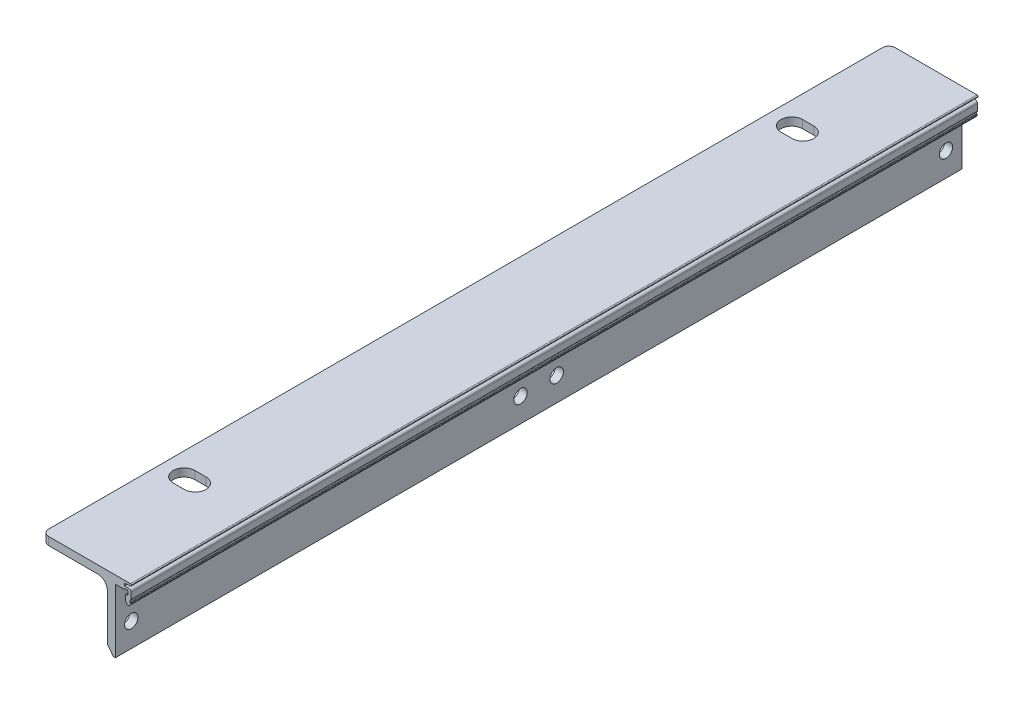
from build123d import *

# Parameters (mm, degrees)
EXTRUDE_1_DEPTH     = 132.675
FILLET_2_R          = 3
CUT_EXTRUDE_1_DEPTH = 2362.760923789
SKETCH_3_R          = 2.1
CUT_EXTRUDE_2_DEPTH = 3316.32239034
FILLET_1_R          = 2


with BuildPart() as part:
    # Sketch 1 → Extrude 1 (new, symmetric)
    with BuildSketch(Plane.XY):
        with BuildLine():
            Line((2329.984035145, -3290.103769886), (2355.384035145, -3290.103769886))
            Line((2355.384035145, -3290.103769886), (2357.624035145, -3290.103769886))
            ThreePointArc((2357.624035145, -3290.103769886), (2357.836167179, -3290.191637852), (2357.924035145, -3290.403769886))
            Line((2357.924035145, -3290.403769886), (2357.924035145, -3290.492459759))
            ThreePointArc((2357.924035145, -3290.492459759), (2357.87266411, -3290.626285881), (2357.744940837, -3290.691364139))
            Line((2357.744940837, -3290.691364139), (2355.903129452, -3290.884946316))
            ThreePointArc((2355.903129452, -3290.884946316), (2355.775406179, -3290.950024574), (2355.724035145, -3291.083850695))
            Line((2355.724035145, -3291.083850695), (2355.724035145, -3291.403769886))
            ThreePointArc((2355.724035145, -3291.403769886), (2355.782613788, -3291.545191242), (2355.924035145, -3291.603769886))
            Line((2355.924035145, -3291.603769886), (2356.769984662, -3291.603769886))
            ThreePointArc((2356.769984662, -3291.603769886), (2357.299096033, -3291.726717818), (2357.719785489, -3292.070367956))
            ThreePointArc((2357.719785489, -3292.070367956), (2357.797255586, -3292.214513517), (2357.824035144, -3292.375952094))
            Line((2357.824035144, -3292.375952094), (2357.824035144, -3294.273769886))
            ThreePointArc((2357.824035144, -3294.273769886), (2357.779946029, -3294.430325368), (2357.660637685, -3294.540864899))
            ThreePointArc((2357.660637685, -3294.540864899), (2357.54132934, -3294.65140443), (2357.497240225, -3294.807959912))
            Line((2357.497240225, -3294.807959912), (2357.497240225, -3295.307959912))
            ThreePointArc((2357.497240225, -3295.307959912), (2357.526529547, -3295.37867059), (2357.597240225, -3295.407959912))
            Line((2357.597240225, -3295.407959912), (2357.724035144, -3295.407959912))
            ThreePointArc((2357.724035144, -3295.407959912), (2357.794745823, -3295.437249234), (2357.824035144, -3295.507959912))
            Line((2357.824035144, -3295.507959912), (2357.824035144, -3295.527361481))
            ThreePointArc((2357.824035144, -3295.527361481), (2357.818000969, -3295.561572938), (2357.800626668, -3295.591655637))
            Line((2357.800626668, -3295.591655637), (2357.383057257, -3296.089092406))
            ThreePointArc((2357.383057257, -3296.089092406), (2356.924035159, -3296.303081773), (2356.465013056, -3296.089092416))
            Line((2356.465013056, -3296.089092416), (2356.094260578, -3295.647427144))
            ThreePointArc((2356.094260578, -3295.647427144), (2356.042137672, -3295.557179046), (2356.024035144, -3295.454544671))
            Line((2356.024035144, -3295.454544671), (2356.024035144, -3294.003769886))
            ThreePointArc((2356.024035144, -3294.003769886), (2356.11190311, -3293.791637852), (2356.324035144, -3293.703769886))
            Line((2356.324035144, -3293.703769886), (2356.524035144, -3293.703769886))
            ThreePointArc((2356.524035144, -3293.703769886), (2356.736167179, -3293.61590192), (2356.824035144, -3293.403769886))
            Line((2356.824035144, -3293.403769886), (2356.824035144, -3292.603769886))
            ThreePointArc((2356.824035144, -3292.603769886), (2356.736167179, -3292.391637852), (2356.524035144, -3292.303769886))
            Line((2356.524035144, -3292.303769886), (2355.987964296, -3292.303769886))
            ThreePointArc((2355.987964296, -3292.303769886), (2355.837964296, -3292.343962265), (2355.728156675, -3292.453769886))
            ThreePointArc((2355.728156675, -3292.453769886), (2355.618349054, -3292.563577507), (2355.468349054, -3292.603769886))
            Line((2355.468349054, -3292.603769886), (2355.384035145, -3292.603769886))
            Line((2355.384035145, -3292.603769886), (2352.884035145, -3292.603769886))
            Line((2352.884035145, -3292.603769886), (2352.884035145, -3312.603769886))
            Line((2352.884035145, -3312.603769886), (2352.284035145, -3312.603769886))
            Line((2352.284035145, -3312.603769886), (2350.384035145, -3310.103769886))
            Line((2350.384035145, -3310.103769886), (2350.384035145, -3292.603769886))
            Line((2350.384035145, -3292.603769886), (2329.984035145, -3292.603769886))
            Line((2329.984035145, -3292.603769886), (2329.984035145, -3290.103769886))
        make_face()
    extrude(amount=EXTRUDE_1_DEPTH, both=True)

    # Fillet 2
    fillet_2_edges = [part.edges().sort_by_distance(p)[0] for p in [
        (2350.384035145, -3292.603769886, 0),
    ]]
    fillet(fillet_2_edges, radius=FILLET_2_R)

    # Sketch 2 → Cut-Extrude 1 (cut, through all)
    with BuildSketch(Plane(origin=(0, -3290.103769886, 0), x_dir=(1, 0, 0), z_dir=(0, 1, 0))):
        with BuildLine():
            Line((2340.484035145, -91.85), (2336.984035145, -91.85))
            ThreePointArc((2336.984035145, -91.85), (2333.584035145, -95.25), (2336.984035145, -98.65))
            Line((2336.984035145, -98.65), (2340.484035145, -98.65))
            ThreePointArc((2340.484035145, -98.65), (2343.884035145, -95.25), (2340.484035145, -91.85))
        make_face()
        with BuildLine():
            Line((2340.484035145, 98.65), (2336.984035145, 98.65))
            ThreePointArc((2336.984035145, 98.65), (2333.584035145, 95.25), (2336.984035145, 91.85))
            Line((2336.984035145, 91.85), (2340.484035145, 91.85))
            ThreePointArc((2340.484035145, 91.85), (2343.884035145, 95.25), (2340.484035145, 98.65))
        make_face()
    extrude(amount=-CUT_EXTRUDE_1_DEPTH, mode=Mode.SUBTRACT)

    # Sketch 3 → Cut-Extrude 2 (cut, through all)
    with BuildSketch(Plane.ZY.offset(-2350.384035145)):
        with Locations(Location((-127.675, -3305.103769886, 0), (0, 0, 270))):
            Circle(SKETCH_3_R)
        with Locations(Location((127.675, -3305.103769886, 0), (0, 0, 270))):
            Circle(SKETCH_3_R)
        with Locations(Location((-5.675, -3305.103769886, 0), (0, 0, 270))):
            Circle(SKETCH_3_R)
        with Locations(Location((5.675, -3305.103769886, 0), (0, 0, 270))):
            Circle(SKETCH_3_R)
    extrude(amount=-CUT_EXTRUDE_2_DEPTH, mode=Mode.SUBTRACT)

    # Fillet 1
    fillet_1_edges = [part.edges().sort_by_distance(p)[0] for p in [
        (2329.984035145, -3291.353769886, 132.675),
        (2329.984035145, -3291.353769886, -132.675),
    ]]
    fillet(fillet_1_edges, radius=FILLET_1_R)


solid = part.part
